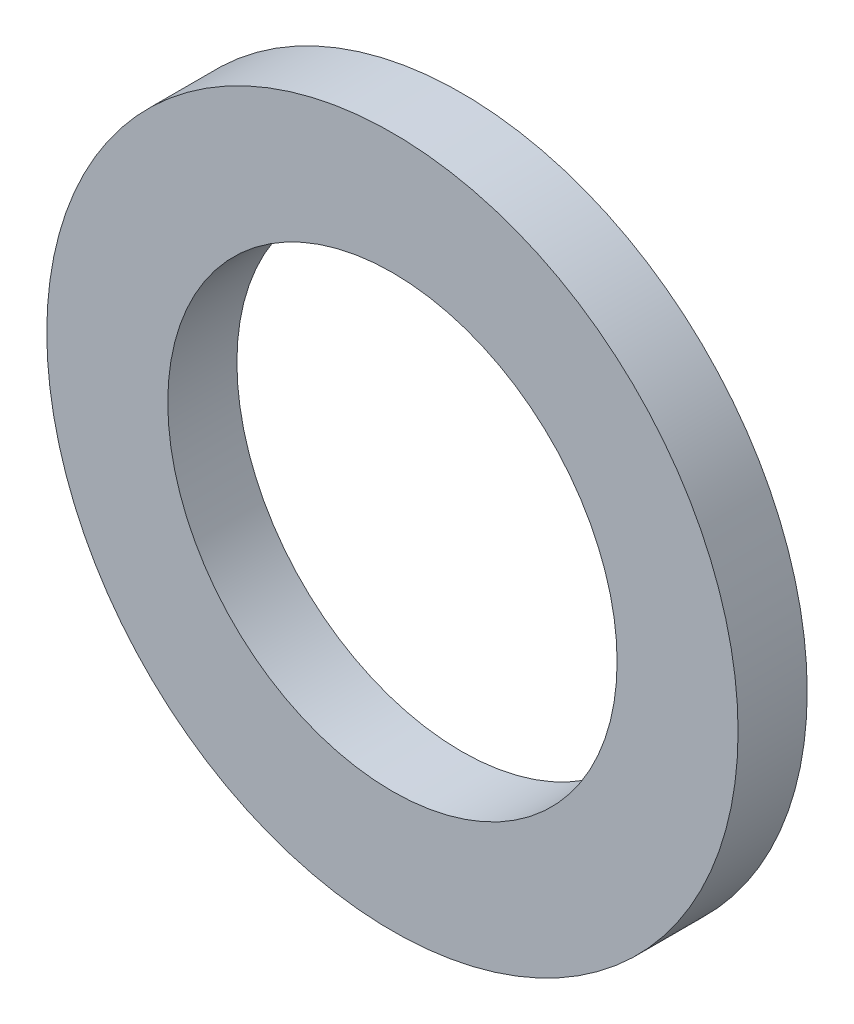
ISO-10303-21;
HEADER;
FILE_DESCRIPTION(('STEP AP214'),'2;1');
FILE_NAME('part.step','',(''),(''),'','','');
FILE_SCHEMA(('AUTOMOTIVE_DESIGN { 1 0 10303 214 1 1 1 1 }'));
ENDSEC;
DATA;
#1=APPLICATION_CONTEXT('core data for automotive mechanical design processes');
#2=APPLICATION_PROTOCOL_DEFINITION('international standard','automotive_design',2000,#1);
#3=PRODUCT_CONTEXT('',#1,'mechanical');
#4=PRODUCT('Part','Part','',(#3));
#5=PRODUCT_RELATED_PRODUCT_CATEGORY('part','',(#4));
#6=PRODUCT_DEFINITION_FORMATION('','',#4);
#7=PRODUCT_DEFINITION_CONTEXT('part definition',#1,'design');
#8=PRODUCT_DEFINITION('design','',#6,#7);
#9=PRODUCT_DEFINITION_SHAPE('','',#8);
#10=(LENGTH_UNIT() NAMED_UNIT(*) SI_UNIT(.MILLI.,.METRE.));
#11=(NAMED_UNIT(*) PLANE_ANGLE_UNIT() SI_UNIT($,.RADIAN.));
#12=(NAMED_UNIT(*) SI_UNIT($,.STERADIAN.) SOLID_ANGLE_UNIT());
#13=UNCERTAINTY_MEASURE_WITH_UNIT(LENGTH_MEASURE(1.E-05),#10,'distance_accuracy_value','');
#14=(GEOMETRIC_REPRESENTATION_CONTEXT(3) GLOBAL_UNCERTAINTY_ASSIGNED_CONTEXT((#13)) GLOBAL_UNIT_ASSIGNED_CONTEXT((#10,
#11,#12)) REPRESENTATION_CONTEXT('',''));
#15=CARTESIAN_POINT('',(0.,0.,0.));
#16=DIRECTION('',(0.,0.,1.));
#17=DIRECTION('',(1.,0.,0.));
#18=AXIS2_PLACEMENT_3D('',#15,#16,#17);
#19=CARTESIAN_POINT('',(0.,20.4890409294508,127.485610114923));
#20=DIRECTION('',(0.,0.,-1.));
#21=DIRECTION('',(-1.,0.,0.));
#22=AXIS2_PLACEMENT_3D('',#19,#20,#21);
#23=PLANE('',#22);
#24=CARTESIAN_POINT('',(0.,20.4890409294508,127.485610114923));
#25=DIRECTION('',(0.,0.,1.));
#26=DIRECTION('',(1.,0.,0.));
#27=AXIS2_PLACEMENT_3D('',#24,#25,#26);
#28=CIRCLE('',#27,6.5);
#29=CARTESIAN_POINT('',(6.50000000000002,20.4890409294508,127.485610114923));
#30=VERTEX_POINT('',#29);
#31=EDGE_CURVE('E25',#30,#30,#28,.F.);
#32=ORIENTED_EDGE('',*,*,#31,.T.);
#33=EDGE_LOOP('',(#32));
#34=FACE_BOUND('',#33,.T.);
#35=CARTESIAN_POINT('',(0.,20.4890409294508,127.485610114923));
#36=DIRECTION('',(0.,0.,1.));
#37=DIRECTION('',(1.,0.,0.));
#38=AXIS2_PLACEMENT_3D('',#35,#36,#37);
#39=CIRCLE('',#38,10.);
#40=CARTESIAN_POINT('',(10.,20.4890409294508,127.485610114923));
#41=VERTEX_POINT('',#40);
#42=EDGE_CURVE('E16',#41,#41,#39,.F.);
#43=ORIENTED_EDGE('',*,*,#42,.F.);
#44=EDGE_LOOP('',(#43));
#45=FACE_BOUND('',#44,.T.);
#46=ADVANCED_FACE('F13',(#34,#45),#23,.F.);
#47=CARTESIAN_POINT('',(0.,20.4890409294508,125.485610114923));
#48=DIRECTION('',(0.,0.,1.));
#49=DIRECTION('',(1.,0.,0.));
#50=AXIS2_PLACEMENT_3D('',#47,#48,#49);
#51=CYLINDRICAL_SURFACE('',#50,10.);
#52=ORIENTED_EDGE('',*,*,#42,.T.);
#53=EDGE_LOOP('',(#52));
#54=FACE_BOUND('',#53,.T.);
#55=CARTESIAN_POINT('',(0.,20.4890409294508,125.485610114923));
#56=DIRECTION('',(0.,0.,1.));
#57=DIRECTION('',(1.,0.,0.));
#58=AXIS2_PLACEMENT_3D('',#55,#56,#57);
#59=CIRCLE('',#58,10.);
#60=CARTESIAN_POINT('',(10.,20.4890409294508,125.485610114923));
#61=VERTEX_POINT('',#60);
#62=EDGE_CURVE('E20',#61,#61,#59,.F.);
#63=ORIENTED_EDGE('',*,*,#62,.F.);
#64=EDGE_LOOP('',(#63));
#65=FACE_BOUND('',#64,.T.);
#66=ADVANCED_FACE('F33',(#54,#65),#51,.T.);
#67=CARTESIAN_POINT('',(0.,20.4890409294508,125.485610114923));
#68=DIRECTION('',(0.,0.,1.));
#69=DIRECTION('',(1.,0.,0.));
#70=AXIS2_PLACEMENT_3D('',#67,#68,#69);
#71=CYLINDRICAL_SURFACE('',#70,6.5);
#72=CARTESIAN_POINT('',(0.,20.4890409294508,125.485610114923));
#73=DIRECTION('',(0.,0.,1.));
#74=DIRECTION('',(1.,0.,0.));
#75=AXIS2_PLACEMENT_3D('',#72,#73,#74);
#76=CIRCLE('',#75,6.5);
#77=CARTESIAN_POINT('',(6.50000000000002,20.4890409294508,125.485610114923));
#78=VERTEX_POINT('',#77);
#79=EDGE_CURVE('E9',#78,#78,#76,.T.);
#80=ORIENTED_EDGE('',*,*,#79,.F.);
#81=EDGE_LOOP('',(#80));
#82=FACE_BOUND('',#81,.T.);
#83=ORIENTED_EDGE('',*,*,#31,.F.);
#84=EDGE_LOOP('',(#83));
#85=FACE_BOUND('',#84,.T.);
#86=ADVANCED_FACE('F42',(#82,#85),#71,.F.);
#87=CARTESIAN_POINT('',(0.,20.4890409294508,125.485610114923));
#88=DIRECTION('',(0.,0.,-1.));
#89=DIRECTION('',(-1.,0.,0.));
#90=AXIS2_PLACEMENT_3D('',#87,#88,#89);
#91=PLANE('',#90);
#92=ORIENTED_EDGE('',*,*,#79,.T.);
#93=EDGE_LOOP('',(#92));
#94=FACE_BOUND('',#93,.T.);
#95=ORIENTED_EDGE('',*,*,#62,.T.);
#96=EDGE_LOOP('',(#95));
#97=FACE_BOUND('',#96,.T.);
#98=ADVANCED_FACE('F43',(#94,#97),#91,.T.);
#99=CLOSED_SHELL('',(#46,#66,#86,#98));
#100=MANIFOLD_SOLID_BREP('B1',#99);
#101=ADVANCED_BREP_SHAPE_REPRESENTATION('',(#18,#100),#14);
#102=SHAPE_DEFINITION_REPRESENTATION(#9,#101);
ENDSEC;
END-ISO-10303-21;
